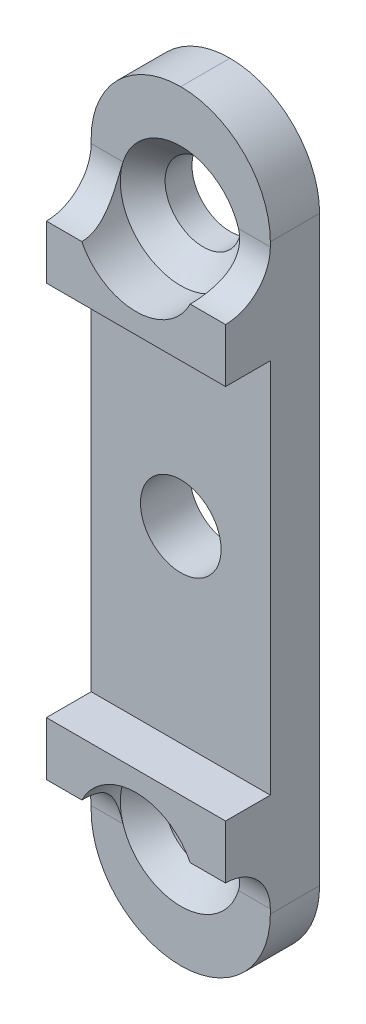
ISO-10303-21;
HEADER;
FILE_DESCRIPTION(('STEP AP214'),'2;1');
FILE_NAME('part.step','',(''),(''),'','','');
FILE_SCHEMA(('AUTOMOTIVE_DESIGN { 1 0 10303 214 1 1 1 1 }'));
ENDSEC;
DATA;
#1=APPLICATION_CONTEXT('core data for automotive mechanical design processes');
#2=APPLICATION_PROTOCOL_DEFINITION('international standard','automotive_design',2000,#1);
#3=PRODUCT_CONTEXT('',#1,'mechanical');
#4=PRODUCT('Part','Part','',(#3));
#5=PRODUCT_RELATED_PRODUCT_CATEGORY('part','',(#4));
#6=PRODUCT_DEFINITION_FORMATION('','',#4);
#7=PRODUCT_DEFINITION_CONTEXT('part definition',#1,'design');
#8=PRODUCT_DEFINITION('design','',#6,#7);
#9=PRODUCT_DEFINITION_SHAPE('','',#8);
#10=(LENGTH_UNIT() NAMED_UNIT(*) SI_UNIT(.MILLI.,.METRE.));
#11=(NAMED_UNIT(*) PLANE_ANGLE_UNIT() SI_UNIT($,.RADIAN.));
#12=(NAMED_UNIT(*) SI_UNIT($,.STERADIAN.) SOLID_ANGLE_UNIT());
#13=UNCERTAINTY_MEASURE_WITH_UNIT(LENGTH_MEASURE(1.E-05),#10,'distance_accuracy_value','');
#14=(GEOMETRIC_REPRESENTATION_CONTEXT(3) GLOBAL_UNCERTAINTY_ASSIGNED_CONTEXT((#13)) GLOBAL_UNIT_ASSIGNED_CONTEXT((#10,
#11,#12)) REPRESENTATION_CONTEXT('',''));
#15=CARTESIAN_POINT('',(0.,0.,0.));
#16=DIRECTION('',(0.,0.,1.));
#17=DIRECTION('',(1.,0.,0.));
#18=AXIS2_PLACEMENT_3D('',#15,#16,#17);
#19=CARTESIAN_POINT('',(0.499999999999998,14.,8.));
#20=DIRECTION('',(0.,0.,-1.));
#21=DIRECTION('',(-1.,0.,0.));
#22=AXIS2_PLACEMENT_3D('',#19,#20,#21);
#23=CYLINDRICAL_SURFACE('',#22,1.7);
#24=CARTESIAN_POINT('',(0.499999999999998,14.,0.));
#25=DIRECTION('',(0.,0.,1.));
#26=DIRECTION('',(1.,0.,0.));
#27=AXIS2_PLACEMENT_3D('',#24,#25,#26);
#28=CIRCLE('',#27,1.7);
#29=CARTESIAN_POINT('',(2.2,14.,0.));
#30=VERTEX_POINT('',#29);
#31=EDGE_CURVE('E224',#30,#30,#28,.T.);
#32=ORIENTED_EDGE('',*,*,#31,.F.);
#33=EDGE_LOOP('',(#32));
#34=FACE_BOUND('',#33,.T.);
#35=CARTESIAN_POINT('',(0.499999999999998,14.,1.2));
#36=DIRECTION('',(0.,0.,1.));
#37=DIRECTION('',(1.,0.,0.));
#38=AXIS2_PLACEMENT_3D('',#35,#36,#37);
#39=CIRCLE('',#38,1.7);
#40=CARTESIAN_POINT('',(2.2,14.,1.2));
#41=VERTEX_POINT('',#40);
#42=EDGE_CURVE('E430',#41,#41,#39,.T.);
#43=ORIENTED_EDGE('',*,*,#42,.T.);
#44=EDGE_LOOP('',(#43));
#45=FACE_BOUND('',#44,.T.);
#46=ADVANCED_FACE('F33',(#34,#45),#23,.F.);
#47=CARTESIAN_POINT('',(0.5,-10.,8.));
#48=DIRECTION('',(0.,0.,-1.));
#49=DIRECTION('',(-1.,0.,0.));
#50=AXIS2_PLACEMENT_3D('',#47,#48,#49);
#51=CYLINDRICAL_SURFACE('',#50,1.7);
#52=CARTESIAN_POINT('',(0.5,-10.,0.));
#53=DIRECTION('',(0.,0.,1.));
#54=DIRECTION('',(1.,0.,0.));
#55=AXIS2_PLACEMENT_3D('',#52,#53,#54);
#56=CIRCLE('',#55,1.7);
#57=CARTESIAN_POINT('',(2.2,-10.,0.));
#58=VERTEX_POINT('',#57);
#59=EDGE_CURVE('E221',#58,#58,#56,.T.);
#60=ORIENTED_EDGE('',*,*,#59,.F.);
#61=EDGE_LOOP('',(#60));
#62=FACE_BOUND('',#61,.T.);
#63=CARTESIAN_POINT('',(0.5,-10.,1.2));
#64=DIRECTION('',(0.,0.,1.));
#65=DIRECTION('',(1.,0.,0.));
#66=AXIS2_PLACEMENT_3D('',#63,#64,#65);
#67=CIRCLE('',#66,1.7);
#68=CARTESIAN_POINT('',(2.2,-10.,1.2));
#69=VERTEX_POINT('',#68);
#70=EDGE_CURVE('E194',#69,#69,#67,.T.);
#71=ORIENTED_EDGE('',*,*,#70,.T.);
#72=EDGE_LOOP('',(#71));
#73=FACE_BOUND('',#72,.T.);
#74=ADVANCED_FACE('F324',(#62,#73),#51,.F.);
#75=CARTESIAN_POINT('',(0.,0.,2.2));
#76=DIRECTION('',(0.,0.,1.));
#77=DIRECTION('',(1.,0.,0.));
#78=AXIS2_PLACEMENT_3D('',#75,#76,#77);
#79=PLANE('',#78);
#80=CARTESIAN_POINT('',(0.500000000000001,-11.,2.2));
#81=DIRECTION('',(0.,0.,1.));
#82=DIRECTION('',(1.,0.,0.));
#83=AXIS2_PLACEMENT_3D('',#80,#81,#82);
#84=CIRCLE('',#83,4.);
#85=CARTESIAN_POINT('',(-3.5,-11.,2.2));
#86=VERTEX_POINT('',#85);
#87=CARTESIAN_POINT('',(0.500000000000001,-15.,2.2));
#88=VERTEX_POINT('',#87);
#89=EDGE_CURVE('E379',#86,#88,#84,.T.);
#90=ORIENTED_EDGE('',*,*,#89,.T.);
#91=CARTESIAN_POINT('',(0.5,-11.,2.2));
#92=DIRECTION('',(0.,0.,1.));
#93=DIRECTION('',(1.,0.,0.));
#94=AXIS2_PLACEMENT_3D('',#91,#92,#93);
#95=CIRCLE('',#94,4.);
#96=CARTESIAN_POINT('',(4.5,-11.,2.2));
#97=VERTEX_POINT('',#96);
#98=EDGE_CURVE('E368',#88,#97,#95,.T.);
#99=ORIENTED_EDGE('',*,*,#98,.T.);
#100=DIRECTION('',(0.,1.,0.));
#101=VECTOR('',#100,1.);
#102=CARTESIAN_POINT('',(4.5,19.,2.2));
#103=LINE('',#102,#101);
#104=CARTESIAN_POINT('',(4.5,-10.8,2.2));
#105=VERTEX_POINT('',#104);
#106=EDGE_CURVE('E234',#97,#105,#103,.T.);
#107=ORIENTED_EDGE('',*,*,#106,.T.);
#108=DIRECTION('',(1.,0.,0.));
#109=VECTOR('',#108,1.);
#110=CARTESIAN_POINT('',(0.,-10.8,2.2));
#111=LINE('',#110,#109);
#112=CARTESIAN_POINT('',(3.07875939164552,-10.8,2.2));
#113=VERTEX_POINT('',#112);
#114=EDGE_CURVE('E248',#105,#113,#111,.F.);
#115=ORIENTED_EDGE('',*,*,#114,.T.);
#116=CARTESIAN_POINT('',(0.5,-10.,2.2));
#117=DIRECTION('',(0.,0.,1.));
#118=DIRECTION('',(1.,0.,0.));
#119=AXIS2_PLACEMENT_3D('',#116,#117,#118);
#120=CIRCLE('',#119,2.7);
#121=CARTESIAN_POINT('',(-2.07875939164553,-10.8,2.2));
#122=VERTEX_POINT('',#121);
#123=EDGE_CURVE('E436',#122,#113,#120,.T.);
#124=ORIENTED_EDGE('',*,*,#123,.F.);
#125=DIRECTION('',(1.,0.,0.));
#126=VECTOR('',#125,1.);
#127=CARTESIAN_POINT('',(0.,-10.8,2.2));
#128=LINE('',#127,#126);
#129=CARTESIAN_POINT('',(-3.5,-10.8,2.2));
#130=VERTEX_POINT('',#129);
#131=EDGE_CURVE('E162',#122,#130,#128,.F.);
#132=ORIENTED_EDGE('',*,*,#131,.T.);
#133=DIRECTION('',(0.,-1.,0.));
#134=VECTOR('',#133,1.);
#135=CARTESIAN_POINT('',(-3.5,19.,2.2));
#136=LINE('',#135,#134);
#137=EDGE_CURVE('E236',#130,#86,#136,.T.);
#138=ORIENTED_EDGE('',*,*,#137,.T.);
#139=EDGE_LOOP('',(#90,#99,#107,#115,#124,#132,#138));
#140=FACE_BOUND('',#139,.T.);
#141=ADVANCED_FACE('F330',(#140),#79,.T.);
#142=CARTESIAN_POINT('',(0.5,2.,2.2));
#143=DIRECTION('',(0.,0.,1.));
#144=DIRECTION('',(1.,0.,0.));
#145=AXIS2_PLACEMENT_3D('',#142,#143,#144);
#146=CIRCLE('',#145,1.8);
#147=CARTESIAN_POINT('',(2.3,2.,2.2));
#148=VERTEX_POINT('',#147);
#149=EDGE_CURVE('E228',#148,#148,#146,.T.);
#150=ORIENTED_EDGE('',*,*,#149,.F.);
#151=EDGE_LOOP('',(#150));
#152=FACE_BOUND('',#151,.T.);
#153=CARTESIAN_POINT('',(-3.5,10.4,2.2));
#154=VERTEX_POINT('',#153);
#155=CARTESIAN_POINT('',(-3.5,-6.4,2.2));
#156=VERTEX_POINT('',#155);
#157=EDGE_CURVE('E241',#154,#156,#136,.T.);
#158=ORIENTED_EDGE('',*,*,#157,.T.);
#159=DIRECTION('',(-1.,0.,0.));
#160=VECTOR('',#159,1.);
#161=CARTESIAN_POINT('',(-3.5,-6.4,2.2));
#162=LINE('',#161,#160);
#163=CARTESIAN_POINT('',(4.5,-6.4,2.2));
#164=VERTEX_POINT('',#163);
#165=EDGE_CURVE('E191',#164,#156,#162,.T.);
#166=ORIENTED_EDGE('',*,*,#165,.F.);
#167=CARTESIAN_POINT('',(4.5,10.4,2.2));
#168=VERTEX_POINT('',#167);
#169=EDGE_CURVE('E237',#164,#168,#103,.T.);
#170=ORIENTED_EDGE('',*,*,#169,.T.);
#171=DIRECTION('',(1.,0.,0.));
#172=VECTOR('',#171,1.);
#173=CARTESIAN_POINT('',(-3.5,10.4,2.2));
#174=LINE('',#173,#172);
#175=EDGE_CURVE('E200',#154,#168,#174,.T.);
#176=ORIENTED_EDGE('',*,*,#175,.F.);
#177=EDGE_LOOP('',(#158,#166,#170,#176));
#178=FACE_BOUND('',#177,.T.);
#179=ADVANCED_FACE('F345',(#152,#178),#79,.T.);
#180=CARTESIAN_POINT('',(4.5,14.8,2.2));
#181=VERTEX_POINT('',#180);
#182=CARTESIAN_POINT('',(4.5,15.,2.2));
#183=VERTEX_POINT('',#182);
#184=EDGE_CURVE('E238',#181,#183,#103,.T.);
#185=ORIENTED_EDGE('',*,*,#184,.T.);
#186=CARTESIAN_POINT('',(0.499999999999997,15.,2.2));
#187=DIRECTION('',(0.,0.,1.));
#188=DIRECTION('',(1.,0.,0.));
#189=AXIS2_PLACEMENT_3D('',#186,#187,#188);
#190=CIRCLE('',#189,4.);
#191=CARTESIAN_POINT('',(0.499999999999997,19.,2.2));
#192=VERTEX_POINT('',#191);
#193=EDGE_CURVE('E11',#183,#192,#190,.T.);
#194=ORIENTED_EDGE('',*,*,#193,.T.);
#195=CARTESIAN_POINT('',(0.499999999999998,15.,2.2));
#196=DIRECTION('',(0.,0.,1.));
#197=DIRECTION('',(1.,0.,0.));
#198=AXIS2_PLACEMENT_3D('',#195,#196,#197);
#199=CIRCLE('',#198,4.);
#200=CARTESIAN_POINT('',(-3.5,15.,2.2));
#201=VERTEX_POINT('',#200);
#202=EDGE_CURVE('E42',#192,#201,#199,.T.);
#203=ORIENTED_EDGE('',*,*,#202,.T.);
#204=CARTESIAN_POINT('',(-3.5,14.8,2.2));
#205=VERTEX_POINT('',#204);
#206=EDGE_CURVE('E239',#201,#205,#136,.T.);
#207=ORIENTED_EDGE('',*,*,#206,.T.);
#208=DIRECTION('',(-1.,0.,0.));
#209=VECTOR('',#208,1.);
#210=CARTESIAN_POINT('',(0.,14.8,2.2));
#211=LINE('',#210,#209);
#212=CARTESIAN_POINT('',(-2.07875939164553,14.8,2.2));
#213=VERTEX_POINT('',#212);
#214=EDGE_CURVE('E251',#205,#213,#211,.F.);
#215=ORIENTED_EDGE('',*,*,#214,.T.);
#216=CARTESIAN_POINT('',(0.499999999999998,14.,2.2));
#217=DIRECTION('',(0.,0.,1.));
#218=DIRECTION('',(1.,0.,0.));
#219=AXIS2_PLACEMENT_3D('',#216,#217,#218);
#220=CIRCLE('',#219,2.7);
#221=CARTESIAN_POINT('',(3.07875939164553,14.8,2.2));
#222=VERTEX_POINT('',#221);
#223=EDGE_CURVE('E426',#222,#213,#220,.T.);
#224=ORIENTED_EDGE('',*,*,#223,.F.);
#225=DIRECTION('',(-1.,0.,0.));
#226=VECTOR('',#225,1.);
#227=CARTESIAN_POINT('',(0.,14.8,2.2));
#228=LINE('',#227,#226);
#229=EDGE_CURVE('E254',#222,#181,#228,.F.);
#230=ORIENTED_EDGE('',*,*,#229,.T.);
#231=EDGE_LOOP('',(#185,#194,#203,#207,#215,#224,#230));
#232=FACE_BOUND('',#231,.T.);
#233=ADVANCED_FACE('F347',(#232),#79,.T.);
#234=CARTESIAN_POINT('',(0.,0.,0.));
#235=DIRECTION('',(0.,0.,1.));
#236=DIRECTION('',(1.,0.,0.));
#237=AXIS2_PLACEMENT_3D('',#234,#235,#236);
#238=PLANE('',#237);
#239=ORIENTED_EDGE('',*,*,#59,.T.);
#240=EDGE_LOOP('',(#239));
#241=FACE_BOUND('',#240,.T.);
#242=ORIENTED_EDGE('',*,*,#31,.T.);
#243=EDGE_LOOP('',(#242));
#244=FACE_BOUND('',#243,.T.);
#245=DIRECTION('',(0.,1.,0.));
#246=VECTOR('',#245,1.);
#247=CARTESIAN_POINT('',(4.5,19.,0.));
#248=LINE('',#247,#246);
#249=CARTESIAN_POINT('',(4.5,-11.,0.));
#250=VERTEX_POINT('',#249);
#251=CARTESIAN_POINT('',(4.5,15.,0.));
#252=VERTEX_POINT('',#251);
#253=EDGE_CURVE('E231',#250,#252,#248,.T.);
#254=ORIENTED_EDGE('',*,*,#253,.F.);
#255=CARTESIAN_POINT('',(0.5,-11.,0.));
#256=DIRECTION('',(0.,0.,1.));
#257=DIRECTION('',(1.,0.,0.));
#258=AXIS2_PLACEMENT_3D('',#255,#256,#257);
#259=CIRCLE('',#258,4.);
#260=CARTESIAN_POINT('',(0.500000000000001,-15.,0.));
#261=VERTEX_POINT('',#260);
#262=EDGE_CURVE('E369',#250,#261,#259,.F.);
#263=ORIENTED_EDGE('',*,*,#262,.T.);
#264=CARTESIAN_POINT('',(0.500000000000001,-11.,0.));
#265=DIRECTION('',(0.,0.,1.));
#266=DIRECTION('',(1.,0.,0.));
#267=AXIS2_PLACEMENT_3D('',#264,#265,#266);
#268=CIRCLE('',#267,4.);
#269=CARTESIAN_POINT('',(-3.5,-11.,0.));
#270=VERTEX_POINT('',#269);
#271=EDGE_CURVE('E376',#261,#270,#268,.F.);
#272=ORIENTED_EDGE('',*,*,#271,.T.);
#273=DIRECTION('',(0.,-1.,0.));
#274=VECTOR('',#273,1.);
#275=CARTESIAN_POINT('',(-3.5,19.,0.));
#276=LINE('',#275,#274);
#277=CARTESIAN_POINT('',(-3.5,15.,0.));
#278=VERTEX_POINT('',#277);
#279=EDGE_CURVE('E244',#278,#270,#276,.T.);
#280=ORIENTED_EDGE('',*,*,#279,.F.);
#281=CARTESIAN_POINT('',(0.499999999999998,15.,0.));
#282=DIRECTION('',(0.,0.,1.));
#283=DIRECTION('',(1.,0.,0.));
#284=AXIS2_PLACEMENT_3D('',#281,#282,#283);
#285=CIRCLE('',#284,4.);
#286=CARTESIAN_POINT('',(0.499999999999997,19.,0.));
#287=VERTEX_POINT('',#286);
#288=EDGE_CURVE('E370',#278,#287,#285,.F.);
#289=ORIENTED_EDGE('',*,*,#288,.T.);
#290=CARTESIAN_POINT('',(0.499999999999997,15.,0.));
#291=DIRECTION('',(0.,0.,1.));
#292=DIRECTION('',(1.,0.,0.));
#293=AXIS2_PLACEMENT_3D('',#290,#291,#292);
#294=CIRCLE('',#293,4.);
#295=EDGE_CURVE('E371',#287,#252,#294,.F.);
#296=ORIENTED_EDGE('',*,*,#295,.T.);
#297=EDGE_LOOP('',(#254,#263,#272,#280,#289,#296));
#298=FACE_BOUND('',#297,.T.);
#299=CARTESIAN_POINT('',(0.5,2.,0.));
#300=DIRECTION('',(0.,0.,1.));
#301=DIRECTION('',(1.,0.,0.));
#302=AXIS2_PLACEMENT_3D('',#299,#300,#301);
#303=CIRCLE('',#302,1.8);
#304=CARTESIAN_POINT('',(2.3,2.,0.));
#305=VERTEX_POINT('',#304);
#306=EDGE_CURVE('E227',#305,#305,#303,.T.);
#307=ORIENTED_EDGE('',*,*,#306,.T.);
#308=EDGE_LOOP('',(#307));
#309=FACE_BOUND('',#308,.T.);
#310=ADVANCED_FACE('F348',(#241,#244,#298,#309),#238,.F.);
#311=CARTESIAN_POINT('',(4.5,19.,2.2));
#312=DIRECTION('',(-1.,0.,0.));
#313=DIRECTION('',(0.,-1.,0.));
#314=AXIS2_PLACEMENT_3D('',#311,#312,#313);
#315=PLANE('',#314);
#316=ORIENTED_EDGE('',*,*,#106,.F.);
#317=DIRECTION('',(0.,0.,-1.));
#318=VECTOR('',#317,1.);
#319=CARTESIAN_POINT('',(4.5,-11.,2.2));
#320=LINE('',#319,#318);
#321=EDGE_CURVE('E362',#97,#250,#320,.T.);
#322=ORIENTED_EDGE('',*,*,#321,.T.);
#323=ORIENTED_EDGE('',*,*,#253,.T.);
#324=DIRECTION('',(0.,0.,-1.));
#325=VECTOR('',#324,1.);
#326=CARTESIAN_POINT('',(4.5,15.,2.2));
#327=LINE('',#326,#325);
#328=EDGE_CURVE('E299',#252,#183,#327,.F.);
#329=ORIENTED_EDGE('',*,*,#328,.T.);
#330=ORIENTED_EDGE('',*,*,#184,.F.);
#331=CARTESIAN_POINT('',(4.5,14.8,4.2));
#332=DIRECTION('',(-1.,0.,0.));
#333=DIRECTION('',(0.,-1.,0.));
#334=AXIS2_PLACEMENT_3D('',#331,#332,#333);
#335=CIRCLE('',#334,2.);
#336=CARTESIAN_POINT('',(4.5,12.8,4.2));
#337=VERTEX_POINT('',#336);
#338=EDGE_CURVE('E413',#181,#337,#335,.T.);
#339=ORIENTED_EDGE('',*,*,#338,.T.);
#340=DIRECTION('',(0.,1.,0.));
#341=VECTOR('',#340,1.);
#342=CARTESIAN_POINT('',(4.5,12.8,4.2));
#343=LINE('',#342,#341);
#344=CARTESIAN_POINT('',(4.5,10.4,4.2));
#345=VERTEX_POINT('',#344);
#346=EDGE_CURVE('E206',#345,#337,#343,.T.);
#347=ORIENTED_EDGE('',*,*,#346,.F.);
#348=DIRECTION('',(0.,0.,-1.));
#349=VECTOR('',#348,1.);
#350=CARTESIAN_POINT('',(4.5,10.4,4.2));
#351=LINE('',#350,#349);
#352=EDGE_CURVE('E213',#345,#168,#351,.T.);
#353=ORIENTED_EDGE('',*,*,#352,.T.);
#354=ORIENTED_EDGE('',*,*,#169,.F.);
#355=DIRECTION('',(0.,0.,-1.));
#356=VECTOR('',#355,1.);
#357=CARTESIAN_POINT('',(4.5,-6.4,4.2));
#358=LINE('',#357,#356);
#359=CARTESIAN_POINT('',(4.5,-6.4,4.2));
#360=VERTEX_POINT('',#359);
#361=EDGE_CURVE('E197',#360,#164,#358,.T.);
#362=ORIENTED_EDGE('',*,*,#361,.F.);
#363=DIRECTION('',(0.,1.,0.));
#364=VECTOR('',#363,1.);
#365=CARTESIAN_POINT('',(4.5,-6.4,4.2));
#366=LINE('',#365,#364);
#367=CARTESIAN_POINT('',(4.5,-8.8,4.2));
#368=VERTEX_POINT('',#367);
#369=EDGE_CURVE('E181',#368,#360,#366,.T.);
#370=ORIENTED_EDGE('',*,*,#369,.F.);
#371=CARTESIAN_POINT('',(4.5,-10.8,4.2));
#372=DIRECTION('',(-1.,0.,0.));
#373=DIRECTION('',(0.,-1.,0.));
#374=AXIS2_PLACEMENT_3D('',#371,#372,#373);
#375=CIRCLE('',#374,2.);
#376=EDGE_CURVE('E256',#368,#105,#375,.T.);
#377=ORIENTED_EDGE('',*,*,#376,.T.);
#378=EDGE_LOOP('',(#316,#322,#323,#329,#330,#339,#347,#353,#354,#362,#370,#377));
#379=FACE_BOUND('',#378,.T.);
#380=ADVANCED_FACE('F351',(#379),#315,.F.);
#381=CARTESIAN_POINT('',(-3.5,19.,2.2));
#382=DIRECTION('',(1.,0.,0.));
#383=DIRECTION('',(0.,1.,0.));
#384=AXIS2_PLACEMENT_3D('',#381,#382,#383);
#385=PLANE('',#384);
#386=ORIENTED_EDGE('',*,*,#279,.T.);
#387=DIRECTION('',(0.,0.,-1.));
#388=VECTOR('',#387,1.);
#389=CARTESIAN_POINT('',(-3.5,-11.,2.2));
#390=LINE('',#389,#388);
#391=EDGE_CURVE('E384',#270,#86,#390,.F.);
#392=ORIENTED_EDGE('',*,*,#391,.T.);
#393=ORIENTED_EDGE('',*,*,#137,.F.);
#394=CARTESIAN_POINT('',(-3.5,-10.8,4.2));
#395=DIRECTION('',(1.,0.,0.));
#396=DIRECTION('',(0.,1.,0.));
#397=AXIS2_PLACEMENT_3D('',#394,#395,#396);
#398=CIRCLE('',#397,2.);
#399=CARTESIAN_POINT('',(-3.5,-8.8,4.2));
#400=VERTEX_POINT('',#399);
#401=EDGE_CURVE('E164',#130,#400,#398,.T.);
#402=ORIENTED_EDGE('',*,*,#401,.T.);
#403=DIRECTION('',(0.,-1.,0.));
#404=VECTOR('',#403,1.);
#405=CARTESIAN_POINT('',(-3.5,-6.4,4.2));
#406=LINE('',#405,#404);
#407=CARTESIAN_POINT('',(-3.5,-6.4,4.2));
#408=VERTEX_POINT('',#407);
#409=EDGE_CURVE('E180',#408,#400,#406,.T.);
#410=ORIENTED_EDGE('',*,*,#409,.F.);
#411=DIRECTION('',(0.,0.,-1.));
#412=VECTOR('',#411,1.);
#413=CARTESIAN_POINT('',(-3.5,-6.4,4.2));
#414=LINE('',#413,#412);
#415=EDGE_CURVE('E190',#408,#156,#414,.T.);
#416=ORIENTED_EDGE('',*,*,#415,.T.);
#417=ORIENTED_EDGE('',*,*,#157,.F.);
#418=DIRECTION('',(0.,0.,-1.));
#419=VECTOR('',#418,1.);
#420=CARTESIAN_POINT('',(-3.5,10.4,4.2));
#421=LINE('',#420,#419);
#422=CARTESIAN_POINT('',(-3.5,10.4,4.2));
#423=VERTEX_POINT('',#422);
#424=EDGE_CURVE('E218',#423,#154,#421,.T.);
#425=ORIENTED_EDGE('',*,*,#424,.F.);
#426=DIRECTION('',(0.,-1.,0.));
#427=VECTOR('',#426,1.);
#428=CARTESIAN_POINT('',(-3.5,12.8,4.2));
#429=LINE('',#428,#427);
#430=CARTESIAN_POINT('',(-3.5,12.8,4.2));
#431=VERTEX_POINT('',#430);
#432=EDGE_CURVE('E201',#431,#423,#429,.T.);
#433=ORIENTED_EDGE('',*,*,#432,.F.);
#434=CARTESIAN_POINT('',(-3.5,14.8,4.2));
#435=DIRECTION('',(1.,0.,0.));
#436=DIRECTION('',(0.,1.,0.));
#437=AXIS2_PLACEMENT_3D('',#434,#435,#436);
#438=CIRCLE('',#437,2.);
#439=EDGE_CURVE('E300',#431,#205,#438,.T.);
#440=ORIENTED_EDGE('',*,*,#439,.T.);
#441=ORIENTED_EDGE('',*,*,#206,.F.);
#442=DIRECTION('',(0.,0.,-1.));
#443=VECTOR('',#442,1.);
#444=CARTESIAN_POINT('',(-3.5,15.,2.2));
#445=LINE('',#444,#443);
#446=EDGE_CURVE('E382',#201,#278,#445,.T.);
#447=ORIENTED_EDGE('',*,*,#446,.T.);
#448=EDGE_LOOP('',(#386,#392,#393,#402,#410,#416,#417,#425,#433,#440,#441,#447));
#449=FACE_BOUND('',#448,.T.);
#450=ADVANCED_FACE('F341',(#449),#385,.F.);
#451=CARTESIAN_POINT('',(0.5,2.,2.2));
#452=DIRECTION('',(0.,0.,-1.));
#453=DIRECTION('',(-1.,0.,0.));
#454=AXIS2_PLACEMENT_3D('',#451,#452,#453);
#455=CYLINDRICAL_SURFACE('',#454,1.8);
#456=ORIENTED_EDGE('',*,*,#149,.T.);
#457=EDGE_LOOP('',(#456));
#458=FACE_BOUND('',#457,.T.);
#459=ORIENTED_EDGE('',*,*,#306,.F.);
#460=EDGE_LOOP('',(#459));
#461=FACE_BOUND('',#460,.T.);
#462=ADVANCED_FACE('F337',(#458,#461),#455,.F.);
#463=CARTESIAN_POINT('',(-3.5,10.4,4.2));
#464=DIRECTION('',(0.,1.,0.));
#465=DIRECTION('',(0.,0.,1.));
#466=AXIS2_PLACEMENT_3D('',#463,#464,#465);
#467=PLANE('',#466);
#468=ORIENTED_EDGE('',*,*,#175,.T.);
#469=ORIENTED_EDGE('',*,*,#352,.F.);
#470=DIRECTION('',(1.,0.,0.));
#471=VECTOR('',#470,1.);
#472=CARTESIAN_POINT('',(-3.5,10.4,4.2));
#473=LINE('',#472,#471);
#474=EDGE_CURVE('E204',#423,#345,#473,.T.);
#475=ORIENTED_EDGE('',*,*,#474,.F.);
#476=ORIENTED_EDGE('',*,*,#424,.T.);
#477=EDGE_LOOP('',(#468,#469,#475,#476));
#478=FACE_BOUND('',#477,.T.);
#479=ADVANCED_FACE('F340',(#478),#467,.F.);
#480=CARTESIAN_POINT('',(0.,0.,4.2));
#481=DIRECTION('',(0.,0.,1.));
#482=DIRECTION('',(1.,0.,0.));
#483=AXIS2_PLACEMENT_3D('',#480,#481,#482);
#484=PLANE('',#483);
#485=DIRECTION('',(-1.,0.,0.));
#486=VECTOR('',#485,1.);
#487=CARTESIAN_POINT('',(-3.5,12.8,4.2));
#488=LINE('',#487,#486);
#489=CARTESIAN_POINT('',(2.91867732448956,12.8,4.2));
#490=VERTEX_POINT('',#489);
#491=EDGE_CURVE('E210',#337,#490,#488,.T.);
#492=ORIENTED_EDGE('',*,*,#491,.T.);
#493=CARTESIAN_POINT('',(0.499999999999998,14.,4.2));
#494=DIRECTION('',(0.,0.,1.));
#495=DIRECTION('',(1.,0.,0.));
#496=AXIS2_PLACEMENT_3D('',#493,#494,#495);
#497=CIRCLE('',#496,2.7);
#498=CARTESIAN_POINT('',(-1.91867732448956,12.8,4.2));
#499=VERTEX_POINT('',#498);
#500=EDGE_CURVE('E174',#490,#499,#497,.F.);
#501=ORIENTED_EDGE('',*,*,#500,.T.);
#502=EDGE_CURVE('E209',#499,#431,#488,.T.);
#503=ORIENTED_EDGE('',*,*,#502,.T.);
#504=ORIENTED_EDGE('',*,*,#432,.T.);
#505=ORIENTED_EDGE('',*,*,#474,.T.);
#506=ORIENTED_EDGE('',*,*,#346,.T.);
#507=EDGE_LOOP('',(#492,#501,#503,#504,#505,#506));
#508=FACE_BOUND('',#507,.T.);
#509=ADVANCED_FACE('F451',(#508),#484,.T.);
#510=CARTESIAN_POINT('',(-3.5,-6.4,4.2));
#511=DIRECTION('',(0.,-1.,0.));
#512=DIRECTION('',(0.,0.,-1.));
#513=AXIS2_PLACEMENT_3D('',#510,#511,#512);
#514=PLANE('',#513);
#515=ORIENTED_EDGE('',*,*,#165,.T.);
#516=ORIENTED_EDGE('',*,*,#415,.F.);
#517=DIRECTION('',(-1.,0.,0.));
#518=VECTOR('',#517,1.);
#519=CARTESIAN_POINT('',(-3.5,-6.4,4.2));
#520=LINE('',#519,#518);
#521=EDGE_CURVE('E184',#360,#408,#520,.T.);
#522=ORIENTED_EDGE('',*,*,#521,.F.);
#523=ORIENTED_EDGE('',*,*,#361,.T.);
#524=EDGE_LOOP('',(#515,#516,#522,#523));
#525=FACE_BOUND('',#524,.T.);
#526=ADVANCED_FACE('F409',(#525),#514,.F.);
#527=CARTESIAN_POINT('',(0.,0.,4.2));
#528=DIRECTION('',(0.,0.,1.));
#529=DIRECTION('',(1.,0.,0.));
#530=AXIS2_PLACEMENT_3D('',#527,#528,#529);
#531=PLANE('',#530);
#532=DIRECTION('',(1.,0.,0.));
#533=VECTOR('',#532,1.);
#534=CARTESIAN_POINT('',(-3.5,-8.8,4.2));
#535=LINE('',#534,#533);
#536=CARTESIAN_POINT('',(-1.91867732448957,-8.8,4.2));
#537=VERTEX_POINT('',#536);
#538=EDGE_CURVE('E161',#400,#537,#535,.T.);
#539=ORIENTED_EDGE('',*,*,#538,.T.);
#540=CARTESIAN_POINT('',(0.5,-10.,4.2));
#541=DIRECTION('',(0.,0.,1.));
#542=DIRECTION('',(1.,0.,0.));
#543=AXIS2_PLACEMENT_3D('',#540,#541,#542);
#544=CIRCLE('',#543,2.7);
#545=CARTESIAN_POINT('',(2.91867732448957,-8.8,4.2));
#546=VERTEX_POINT('',#545);
#547=EDGE_CURVE('E168',#537,#546,#544,.F.);
#548=ORIENTED_EDGE('',*,*,#547,.T.);
#549=EDGE_CURVE('E182',#546,#368,#535,.T.);
#550=ORIENTED_EDGE('',*,*,#549,.T.);
#551=ORIENTED_EDGE('',*,*,#369,.T.);
#552=ORIENTED_EDGE('',*,*,#521,.T.);
#553=ORIENTED_EDGE('',*,*,#409,.T.);
#554=EDGE_LOOP('',(#539,#548,#550,#551,#552,#553));
#555=FACE_BOUND('',#554,.T.);
#556=ADVANCED_FACE('F178',(#555),#531,.T.);
#557=CARTESIAN_POINT('',(0.5,-10.,2.2));
#558=DIRECTION('',(0.,0.,1.));
#559=DIRECTION('',(1.,0.,0.));
#560=AXIS2_PLACEMENT_3D('',#557,#558,#559);
#561=CONICAL_SURFACE('',#560,2.7,0.78539816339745);
#562=ORIENTED_EDGE('',*,*,#70,.F.);
#563=EDGE_LOOP('',(#562));
#564=FACE_BOUND('',#563,.T.);
#565=EDGE_CURVE('E437',#113,#122,#120,.T.);
#566=ORIENTED_EDGE('',*,*,#565,.T.);
#567=ORIENTED_EDGE('',*,*,#123,.T.);
#568=EDGE_LOOP('',(#566,#567));
#569=FACE_BOUND('',#568,.T.);
#570=ADVANCED_FACE('F442',(#564,#569),#561,.F.);
#571=CARTESIAN_POINT('',(0.499999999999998,14.,2.2));
#572=DIRECTION('',(0.,0.,1.));
#573=DIRECTION('',(1.,0.,0.));
#574=AXIS2_PLACEMENT_3D('',#571,#572,#573);
#575=CONICAL_SURFACE('',#574,2.7,0.78539816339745);
#576=ORIENTED_EDGE('',*,*,#42,.F.);
#577=EDGE_LOOP('',(#576));
#578=FACE_BOUND('',#577,.T.);
#579=EDGE_CURVE('E428',#213,#222,#220,.T.);
#580=ORIENTED_EDGE('',*,*,#579,.T.);
#581=ORIENTED_EDGE('',*,*,#223,.T.);
#582=EDGE_LOOP('',(#580,#581));
#583=FACE_BOUND('',#582,.T.);
#584=ADVANCED_FACE('F280',(#578,#583),#575,.F.);
#585=CARTESIAN_POINT('',(0.499999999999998,14.,10.2));
#586=DIRECTION('',(0.,0.,-1.));
#587=DIRECTION('',(-1.,0.,0.));
#588=AXIS2_PLACEMENT_3D('',#585,#586,#587);
#589=CYLINDRICAL_SURFACE('',#588,2.7);
#590=ORIENTED_EDGE('',*,*,#579,.F.);
#591=CARTESIAN_POINT('',(-2.07875939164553,14.8,2.2));
#592=CARTESIAN_POINT('',(-2.09272725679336,14.7550062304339,2.19999177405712));
#593=CARTESIAN_POINT('',(-2.10550154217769,14.7096370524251,2.20151832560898));
#594=CARTESIAN_POINT('',(-2.12862312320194,14.6184965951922,2.20773128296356));
#595=CARTESIAN_POINT('',(-2.13897028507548,14.5727252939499,2.21241786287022));
#596=CARTESIAN_POINT('',(-2.15716291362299,14.4813018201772,2.22501811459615));
#597=CARTESIAN_POINT('',(-2.16501739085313,14.4356498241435,2.23291992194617));
#598=CARTESIAN_POINT('',(-2.1783031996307,14.3446866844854,2.25196171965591));
#599=CARTESIAN_POINT('',(-2.18373473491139,14.2993755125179,2.26310143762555));
#600=CARTESIAN_POINT('',(-2.19649934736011,14.1644048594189,2.30138503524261));
#601=CARTESIAN_POINT('',(-2.20030024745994,14.0757195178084,2.33339182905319));
#602=CARTESIAN_POINT('',(-2.19966103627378,13.903831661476,2.40954026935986));
#603=CARTESIAN_POINT('',(-2.19521819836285,13.8206309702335,2.45368592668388));
#604=CARTESIAN_POINT('',(-2.17977470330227,13.6602801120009,2.55375384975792));
#605=CARTESIAN_POINT('',(-2.16865927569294,13.5832632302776,2.60987087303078));
#606=CARTESIAN_POINT('',(-2.14197544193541,13.4383917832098,2.73200271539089));
#607=CARTESIAN_POINT('',(-2.12640423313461,13.3705430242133,2.7980237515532));
#608=CARTESIAN_POINT('',(-2.09093158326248,13.2368050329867,2.947887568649));
#609=CARTESIAN_POINT('',(-2.07073006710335,13.1723394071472,3.03293207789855));
#610=CARTESIAN_POINT('',(-2.03093104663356,13.0576171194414,3.21235053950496));
#611=CARTESIAN_POINT('',(-2.01133410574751,13.0073733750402,3.30673286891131));
#612=CARTESIAN_POINT('',(-1.97476761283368,12.9192712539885,3.51006786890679));
#613=CARTESIAN_POINT('',(-1.95809082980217,12.8825723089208,3.61958067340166));
#614=CARTESIAN_POINT('',(-1.93283475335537,12.8285749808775,3.84402996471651));
#615=CARTESIAN_POINT('',(-1.92423090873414,12.8112177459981,3.9589488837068));
#616=CARTESIAN_POINT('',(-1.91997913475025,12.8026290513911,4.0953413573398));
#617=CARTESIAN_POINT('',(-1.91949137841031,12.8016430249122,4.11626818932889));
#618=CARTESIAN_POINT('',(-1.9188414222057,12.8003295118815,4.1581276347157));
#619=CARTESIAN_POINT('',(-1.91867891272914,12.8000013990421,4.17906022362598));
#620=CARTESIAN_POINT('',(-1.91867732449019,12.8,4.20000000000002));
#621=B_SPLINE_CURVE_WITH_KNOTS('',3,(#591,#592,#593,#594,#595,#596,#597,#598,#599,#600,#601,
#602,#603,#604,#605,#606,#607,#608,#609,#610,#611,#612,#613,#614,#615,#616,#617,#618,#619,#620),
.UNSPECIFIED.,.F.,.F.,(4,2,2,2,2,2,2,2,2,2,2,2,2,2,4),(0.,0.141300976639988,0.282609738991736,
0.423401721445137,0.56418186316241,0.845776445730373,1.12746418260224,1.41414170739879,
1.70099994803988,2.02547375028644,2.35024132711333,2.69851159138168,3.04571923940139,
3.10858086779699,3.17138262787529),.UNSPECIFIED.);
#622=EDGE_CURVE('E292',#213,#499,#621,.T.);
#623=ORIENTED_EDGE('',*,*,#622,.T.);
#624=ORIENTED_EDGE('',*,*,#500,.F.);
#625=CARTESIAN_POINT('',(2.91867732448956,12.8,4.2));
#626=CARTESIAN_POINT('',(2.91865807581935,12.7999911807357,4.14614511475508));
#627=CARTESIAN_POINT('',(2.91975610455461,12.8021749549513,4.09229919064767));
#628=CARTESIAN_POINT('',(2.92404258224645,12.8108574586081,3.98507180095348));
#629=CARTESIAN_POINT('',(2.92722976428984,12.817353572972,3.93169007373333));
#630=CARTESIAN_POINT('',(2.93552871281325,12.8345450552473,3.82605170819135));
#631=CARTESIAN_POINT('',(2.94063020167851,12.8452180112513,3.77379060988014));
#632=CARTESIAN_POINT('',(2.95249675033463,12.8706391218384,3.67047187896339));
#633=CARTESIAN_POINT('',(2.95926200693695,12.88538775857,3.61941438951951));
#634=CARTESIAN_POINT('',(2.98156137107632,12.9354825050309,3.46873826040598));
#635=CARTESIAN_POINT('',(2.99912581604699,12.9767273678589,3.3713143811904));
#636=CARTESIAN_POINT('',(3.03670364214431,13.0738056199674,3.18442857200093));
#637=CARTESIAN_POINT('',(3.0567213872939,13.1296652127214,3.09498133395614));
#638=CARTESIAN_POINT('',(3.09731475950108,13.2591454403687,2.92000010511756));
#639=CARTESIAN_POINT('',(3.11783445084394,13.3337216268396,2.83515552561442));
#640=CARTESIAN_POINT('',(3.15398448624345,13.4966950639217,2.6787730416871));
#641=CARTESIAN_POINT('',(3.16961862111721,13.5850815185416,2.6072248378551));
#642=CARTESIAN_POINT('',(3.19193337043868,13.7716732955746,2.48099968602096));
#643=CARTESIAN_POINT('',(3.19878735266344,13.8696460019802,2.42601300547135));
#644=CARTESIAN_POINT('',(3.20091370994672,14.0735337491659,2.33325262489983));
#645=CARTESIAN_POINT('',(3.19619956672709,14.1794394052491,2.29545894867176));
#646=CARTESIAN_POINT('',(3.1756249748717,14.3719354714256,2.24436901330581));
#647=CARTESIAN_POINT('',(3.16232675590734,14.4578854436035,2.22758609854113));
#648=CARTESIAN_POINT('',(3.13586926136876,14.5866258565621,2.21094014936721));
#649=CARTESIAN_POINT('',(3.12594193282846,14.6295836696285,2.20681319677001));
#650=CARTESIAN_POINT('',(3.10394697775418,14.7151326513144,2.20134133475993));
#651=CARTESIAN_POINT('',(3.0918791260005,14.7577237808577,2.19999671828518));
#652=CARTESIAN_POINT('',(3.07875939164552,14.8,2.2));
#653=B_SPLINE_CURVE_WITH_KNOTS('',3,(#625,#626,#627,#628,#629,#630,#631,#632,#633,#634,#635,
#636,#637,#638,#639,#640,#641,#642,#643,#644,#645,#646,#647,#648,#649,#650,#651,#652),
.UNSPECIFIED.,.F.,.F.,(4,2,2,2,2,2,2,2,2,2,2,2,2,4),(0.,0.161494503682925,0.322891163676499,
0.483433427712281,0.643994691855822,0.964208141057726,1.28499969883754,1.62779810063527,
1.97032985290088,2.30598830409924,2.64125575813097,2.90576950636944,3.03849226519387,
3.17122899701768),.UNSPECIFIED.);
#654=EDGE_CURVE('E285',#490,#222,#653,.T.);
#655=ORIENTED_EDGE('',*,*,#654,.T.);
#656=EDGE_LOOP('',(#590,#623,#624,#655));
#657=FACE_BOUND('',#656,.T.);
#658=ADVANCED_FACE('F275',(#657),#589,.F.);
#659=CARTESIAN_POINT('',(0.5,-10.,10.2));
#660=DIRECTION('',(0.,0.,-1.));
#661=DIRECTION('',(-1.,0.,0.));
#662=AXIS2_PLACEMENT_3D('',#659,#660,#661);
#663=CYLINDRICAL_SURFACE('',#662,2.7);
#664=ORIENTED_EDGE('',*,*,#565,.F.);
#665=CARTESIAN_POINT('',(3.07875939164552,-10.8,2.2));
#666=CARTESIAN_POINT('',(3.09272725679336,-10.7550062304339,2.19999177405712));
#667=CARTESIAN_POINT('',(3.10550154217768,-10.7096370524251,2.20151832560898));
#668=CARTESIAN_POINT('',(3.12862312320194,-10.6184965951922,2.20773128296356));
#669=CARTESIAN_POINT('',(3.13897028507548,-10.5727252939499,2.21241786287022));
#670=CARTESIAN_POINT('',(3.15716291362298,-10.4813018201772,2.22501811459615));
#671=CARTESIAN_POINT('',(3.16501739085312,-10.4356498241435,2.23291992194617));
#672=CARTESIAN_POINT('',(3.1783031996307,-10.3446866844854,2.25196171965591));
#673=CARTESIAN_POINT('',(3.18373473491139,-10.2993755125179,2.26310143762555));
#674=CARTESIAN_POINT('',(3.1964993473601,-10.1644048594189,2.30138503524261));
#675=CARTESIAN_POINT('',(3.20030024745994,-10.0757195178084,2.33339182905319));
#676=CARTESIAN_POINT('',(3.19966103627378,-9.90383166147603,2.40954026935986));
#677=CARTESIAN_POINT('',(3.19521819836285,-9.82063097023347,2.45368592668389));
#678=CARTESIAN_POINT('',(3.17977470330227,-9.66028011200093,2.55375384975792));
#679=CARTESIAN_POINT('',(3.16865927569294,-9.58326323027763,2.60987087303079));
#680=CARTESIAN_POINT('',(3.14197544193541,-9.43839178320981,2.73200271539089));
#681=CARTESIAN_POINT('',(3.12640423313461,-9.37054302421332,2.7980237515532));
#682=CARTESIAN_POINT('',(3.09093158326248,-9.23680503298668,2.947887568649));
#683=CARTESIAN_POINT('',(3.07073006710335,-9.1723394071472,3.03293207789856));
#684=CARTESIAN_POINT('',(3.03093104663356,-9.05761711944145,3.21235053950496));
#685=CARTESIAN_POINT('',(3.01133410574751,-9.0073733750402,3.30673286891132));
#686=CARTESIAN_POINT('',(2.97476761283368,-8.9192712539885,3.5100678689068));
#687=CARTESIAN_POINT('',(2.95809082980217,-8.88257230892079,3.61958067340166));
#688=CARTESIAN_POINT('',(2.93283475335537,-8.82857498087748,3.84402996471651));
#689=CARTESIAN_POINT('',(2.92423090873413,-8.81121774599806,3.95894888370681));
#690=CARTESIAN_POINT('',(2.91997913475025,-8.80262905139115,4.0953413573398));
#691=CARTESIAN_POINT('',(2.91949137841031,-8.80164302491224,4.11626818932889));
#692=CARTESIAN_POINT('',(2.9188414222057,-8.80032951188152,4.1581276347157));
#693=CARTESIAN_POINT('',(2.91867891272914,-8.80000139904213,4.17906022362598));
#694=CARTESIAN_POINT('',(2.91867732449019,-8.8,4.20000000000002));
#695=B_SPLINE_CURVE_WITH_KNOTS('',3,(#665,#666,#667,#668,#669,#670,#671,#672,#673,#674,#675,
#676,#677,#678,#679,#680,#681,#682,#683,#684,#685,#686,#687,#688,#689,#690,#691,#692,#693,#694),
.UNSPECIFIED.,.F.,.F.,(4,2,2,2,2,2,2,2,2,2,2,2,2,2,4),(0.,0.141300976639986,0.282609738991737,
0.423401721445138,0.564181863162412,0.845776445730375,1.12746418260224,1.41414170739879,
1.70099994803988,2.02547375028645,2.35024132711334,2.69851159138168,3.04571923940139,
3.108580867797,3.17138262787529),.UNSPECIFIED.);
#696=EDGE_CURVE('E165',#113,#546,#695,.T.);
#697=ORIENTED_EDGE('',*,*,#696,.T.);
#698=ORIENTED_EDGE('',*,*,#547,.F.);
#699=CARTESIAN_POINT('',(-1.91867732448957,-8.8,4.2));
#700=CARTESIAN_POINT('',(-1.91865807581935,-8.79999118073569,4.14614511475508));
#701=CARTESIAN_POINT('',(-1.91975610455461,-8.80217495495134,4.09229919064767));
#702=CARTESIAN_POINT('',(-1.92404258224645,-8.81085745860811,3.98507180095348));
#703=CARTESIAN_POINT('',(-1.92722976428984,-8.81735357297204,3.93169007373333));
#704=CARTESIAN_POINT('',(-1.93552871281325,-8.83454505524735,3.82605170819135));
#705=CARTESIAN_POINT('',(-1.94063020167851,-8.84521801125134,3.77379060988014));
#706=CARTESIAN_POINT('',(-1.95249675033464,-8.87063912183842,3.67047187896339));
#707=CARTESIAN_POINT('',(-1.95926200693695,-8.88538775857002,3.61941438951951));
#708=CARTESIAN_POINT('',(-1.98156137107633,-8.93548250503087,3.46873826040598));
#709=CARTESIAN_POINT('',(-1.99912581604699,-8.97672736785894,3.3713143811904));
#710=CARTESIAN_POINT('',(-2.03670364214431,-9.07380561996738,3.18442857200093));
#711=CARTESIAN_POINT('',(-2.05672138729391,-9.12966521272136,3.09498133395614));
#712=CARTESIAN_POINT('',(-2.09731475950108,-9.25914544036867,2.92000010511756));
#713=CARTESIAN_POINT('',(-2.11783445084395,-9.33372162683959,2.83515552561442));
#714=CARTESIAN_POINT('',(-2.15398448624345,-9.49669506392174,2.6787730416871));
#715=CARTESIAN_POINT('',(-2.16961862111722,-9.58508151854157,2.6072248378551));
#716=CARTESIAN_POINT('',(-2.19193337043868,-9.77167329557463,2.48099968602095));
#717=CARTESIAN_POINT('',(-2.19878735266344,-9.86964600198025,2.42601300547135));
#718=CARTESIAN_POINT('',(-2.20091370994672,-10.0735337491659,2.33325262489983));
#719=CARTESIAN_POINT('',(-2.19619956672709,-10.1794394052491,2.29545894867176));
#720=CARTESIAN_POINT('',(-2.1756249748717,-10.3719354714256,2.24436901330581));
#721=CARTESIAN_POINT('',(-2.16232675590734,-10.4578854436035,2.22758609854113));
#722=CARTESIAN_POINT('',(-2.13586926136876,-10.5866258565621,2.21094014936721));
#723=CARTESIAN_POINT('',(-2.12594193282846,-10.6295836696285,2.20681319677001));
#724=CARTESIAN_POINT('',(-2.10394697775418,-10.7151326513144,2.20134133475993));
#725=CARTESIAN_POINT('',(-2.0918791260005,-10.7577237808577,2.19999671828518));
#726=CARTESIAN_POINT('',(-2.07875939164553,-10.8,2.2));
#727=B_SPLINE_CURVE_WITH_KNOTS('',3,(#699,#700,#701,#702,#703,#704,#705,#706,#707,#708,#709,
#710,#711,#712,#713,#714,#715,#716,#717,#718,#719,#720,#721,#722,#723,#724,#725,#726),
.UNSPECIFIED.,.F.,.F.,(4,2,2,2,2,2,2,2,2,2,2,2,2,4),(0.,0.161494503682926,0.3228911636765,
0.483433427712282,0.643994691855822,0.964208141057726,1.28499969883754,1.62779810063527,
1.97032985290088,2.30598830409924,2.64125575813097,2.90576950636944,3.03849226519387,
3.17122899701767),.UNSPECIFIED.);
#728=EDGE_CURVE('E156',#537,#122,#727,.T.);
#729=ORIENTED_EDGE('',*,*,#728,.T.);
#730=EDGE_LOOP('',(#664,#697,#698,#729));
#731=FACE_BOUND('',#730,.T.);
#732=ADVANCED_FACE('F169',(#731),#663,.F.);
#733=CARTESIAN_POINT('',(-3.5,-10.8,4.2));
#734=DIRECTION('',(1.,0.,0.));
#735=DIRECTION('',(0.,0.,-1.));
#736=AXIS2_PLACEMENT_3D('',#733,#734,#735);
#737=CYLINDRICAL_SURFACE('',#736,2.);
#738=ORIENTED_EDGE('',*,*,#696,.F.);
#739=ORIENTED_EDGE('',*,*,#114,.F.);
#740=ORIENTED_EDGE('',*,*,#376,.F.);
#741=ORIENTED_EDGE('',*,*,#549,.F.);
#742=EDGE_LOOP('',(#738,#739,#740,#741));
#743=FACE_BOUND('',#742,.T.);
#744=ADVANCED_FACE('F269',(#743),#737,.F.);
#745=CARTESIAN_POINT('',(-3.5,-10.8,4.2));
#746=DIRECTION('',(1.,0.,0.));
#747=DIRECTION('',(0.,0.,-1.));
#748=AXIS2_PLACEMENT_3D('',#745,#746,#747);
#749=CYLINDRICAL_SURFACE('',#748,2.);
#750=ORIENTED_EDGE('',*,*,#401,.F.);
#751=ORIENTED_EDGE('',*,*,#131,.F.);
#752=ORIENTED_EDGE('',*,*,#728,.F.);
#753=ORIENTED_EDGE('',*,*,#538,.F.);
#754=EDGE_LOOP('',(#750,#751,#752,#753));
#755=FACE_BOUND('',#754,.T.);
#756=ADVANCED_FACE('F159',(#755),#749,.F.);
#757=CARTESIAN_POINT('',(-3.5,14.8,4.2));
#758=DIRECTION('',(-1.,0.,0.));
#759=DIRECTION('',(0.,0.,1.));
#760=AXIS2_PLACEMENT_3D('',#757,#758,#759);
#761=CYLINDRICAL_SURFACE('',#760,2.);
#762=ORIENTED_EDGE('',*,*,#338,.F.);
#763=ORIENTED_EDGE('',*,*,#229,.F.);
#764=ORIENTED_EDGE('',*,*,#654,.F.);
#765=ORIENTED_EDGE('',*,*,#491,.F.);
#766=EDGE_LOOP('',(#762,#763,#764,#765));
#767=FACE_BOUND('',#766,.T.);
#768=ADVANCED_FACE('F307',(#767),#761,.F.);
#769=CARTESIAN_POINT('',(-3.5,14.8,4.2));
#770=DIRECTION('',(-1.,0.,0.));
#771=DIRECTION('',(0.,0.,1.));
#772=AXIS2_PLACEMENT_3D('',#769,#770,#771);
#773=CYLINDRICAL_SURFACE('',#772,2.);
#774=ORIENTED_EDGE('',*,*,#622,.F.);
#775=ORIENTED_EDGE('',*,*,#214,.F.);
#776=ORIENTED_EDGE('',*,*,#439,.F.);
#777=ORIENTED_EDGE('',*,*,#502,.F.);
#778=EDGE_LOOP('',(#774,#775,#776,#777));
#779=FACE_BOUND('',#778,.T.);
#780=ADVANCED_FACE('F302',(#779),#773,.F.);
#781=CARTESIAN_POINT('',(0.500000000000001,-11.,2.2));
#782=DIRECTION('',(0.,0.,-1.));
#783=DIRECTION('',(-1.,0.,0.));
#784=AXIS2_PLACEMENT_3D('',#781,#782,#783);
#785=CYLINDRICAL_SURFACE('',#784,4.);
#786=DIRECTION('',(0.,0.,-1.));
#787=VECTOR('',#786,1.);
#788=CARTESIAN_POINT('',(0.500000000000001,-15.,2.2));
#789=LINE('',#788,#787);
#790=EDGE_CURVE('E175',#88,#261,#789,.T.);
#791=ORIENTED_EDGE('',*,*,#790,.F.);
#792=ORIENTED_EDGE('',*,*,#89,.F.);
#793=ORIENTED_EDGE('',*,*,#391,.F.);
#794=ORIENTED_EDGE('',*,*,#271,.F.);
#795=EDGE_LOOP('',(#791,#792,#793,#794));
#796=FACE_BOUND('',#795,.T.);
#797=ADVANCED_FACE('F306',(#796),#785,.T.);
#798=CARTESIAN_POINT('',(0.5,-11.,2.2));
#799=DIRECTION('',(0.,0.,-1.));
#800=DIRECTION('',(-1.,0.,0.));
#801=AXIS2_PLACEMENT_3D('',#798,#799,#800);
#802=CYLINDRICAL_SURFACE('',#801,4.);
#803=ORIENTED_EDGE('',*,*,#98,.F.);
#804=ORIENTED_EDGE('',*,*,#790,.T.);
#805=ORIENTED_EDGE('',*,*,#262,.F.);
#806=ORIENTED_EDGE('',*,*,#321,.F.);
#807=EDGE_LOOP('',(#803,#804,#805,#806));
#808=FACE_BOUND('',#807,.T.);
#809=ADVANCED_FACE('F310',(#808),#802,.T.);
#810=CARTESIAN_POINT('',(0.499999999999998,15.,2.2));
#811=DIRECTION('',(0.,0.,-1.));
#812=DIRECTION('',(-1.,0.,0.));
#813=AXIS2_PLACEMENT_3D('',#810,#811,#812);
#814=CYLINDRICAL_SURFACE('',#813,4.);
#815=ORIENTED_EDGE('',*,*,#446,.F.);
#816=ORIENTED_EDGE('',*,*,#202,.F.);
#817=DIRECTION('',(0.,0.,-1.));
#818=VECTOR('',#817,1.);
#819=CARTESIAN_POINT('',(0.499999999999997,19.,2.2));
#820=LINE('',#819,#818);
#821=EDGE_CURVE('E37',#287,#192,#820,.F.);
#822=ORIENTED_EDGE('',*,*,#821,.F.);
#823=ORIENTED_EDGE('',*,*,#288,.F.);
#824=EDGE_LOOP('',(#815,#816,#822,#823));
#825=FACE_BOUND('',#824,.T.);
#826=ADVANCED_FACE('F35',(#825),#814,.T.);
#827=CARTESIAN_POINT('',(0.499999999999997,15.,2.2));
#828=DIRECTION('',(0.,0.,-1.));
#829=DIRECTION('',(-1.,0.,0.));
#830=AXIS2_PLACEMENT_3D('',#827,#828,#829);
#831=CYLINDRICAL_SURFACE('',#830,4.);
#832=ORIENTED_EDGE('',*,*,#193,.F.);
#833=ORIENTED_EDGE('',*,*,#328,.F.);
#834=ORIENTED_EDGE('',*,*,#295,.F.);
#835=ORIENTED_EDGE('',*,*,#821,.T.);
#836=EDGE_LOOP('',(#832,#833,#834,#835));
#837=FACE_BOUND('',#836,.T.);
#838=ADVANCED_FACE('F316',(#837),#831,.T.);
#839=CLOSED_SHELL('',(#46,#74,#141,#179,#233,#310,#380,#450,#462,#479,#509,#526,#556,#570,#584,
#658,#732,#744,#756,#768,#780,#797,#809,#826,#838));
#840=MANIFOLD_SOLID_BREP('B2',#839);
#841=ADVANCED_BREP_SHAPE_REPRESENTATION('',(#18,#840),#14);
#842=SHAPE_DEFINITION_REPRESENTATION(#9,#841);
ENDSEC;
END-ISO-10303-21;
